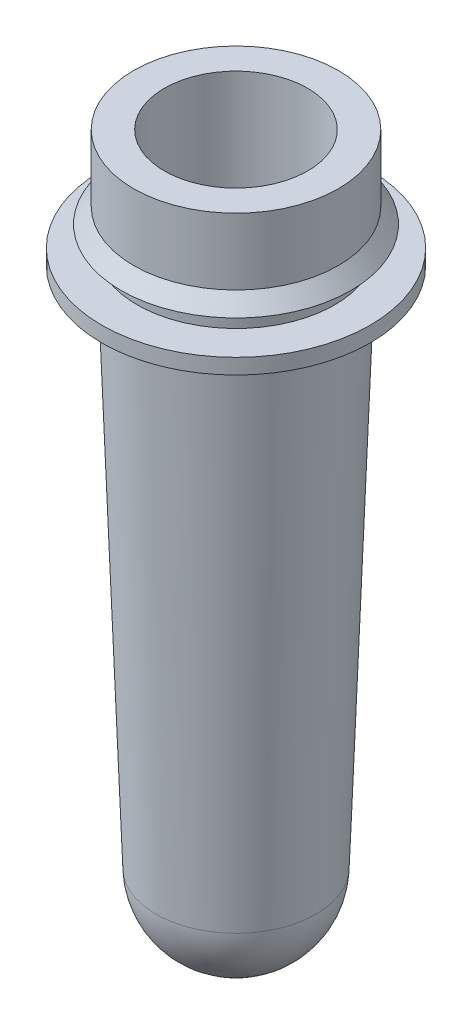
from build123d import *


with BuildPart() as part:
    # Sketch2 → Revolve1 (revolve)
    with BuildSketch(Plane(origin=(0, 0, 0), x_dir=(0, 0, -1), z_dir=(1, 0, 0))):
        with BuildLine():
            Line((13.098411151, 60), (9.650792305, 60))
            Line((9.650792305, 60), (9.720633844, 62))
            Line((9.720633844, 62), (11.220633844, 62))
            Line((11.220633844, 62), (10, 63.5))
            Line((10, 63.5), (10, 70))
            Line((10, 70), (7, 70))
            Line((7, 70), (7, 60))
            Line((7, 60), (6.596582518, 58.5))
            Line((6.596582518, 58.5), (4.821058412, 7.655641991))
            ThreePointArc((4.821058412, 7.655641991), (3.351029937, 4.353903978), (0, 3))
            Line((0, 3), (0, 0))
            ThreePointArc((0, 0), (5.435005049, 2.195884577), (7.819230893, 7.550943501))
            Line((7.819230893, 7.550943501), (9.598411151, 58.5))
            Line((9.598411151, 58.5), (13.098411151, 58.5))
            Line((13.098411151, 58.5), (13.098411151, 60))
        make_face()
    revolve(axis=Axis((0, 0, 0), (0, 1, 0)))


solid = part.part
